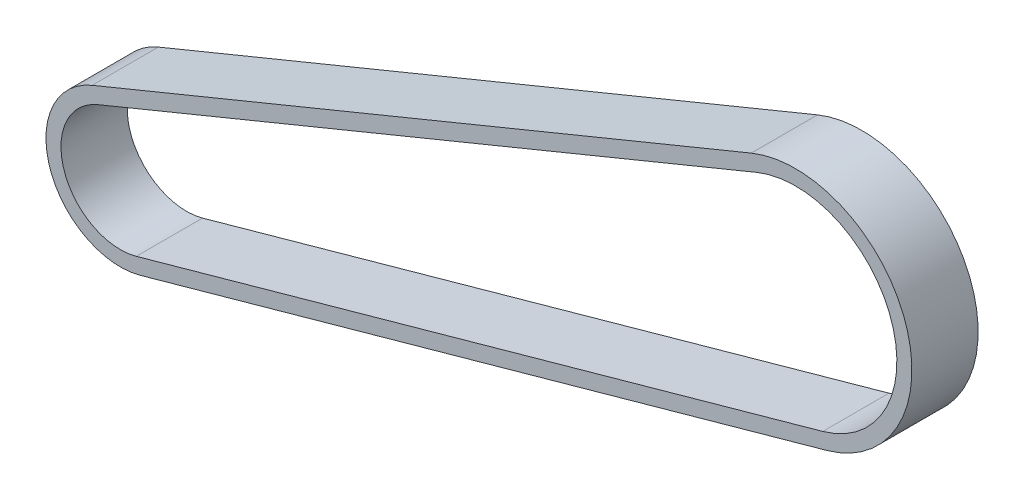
from build123d import *

# Parameters (mm, degrees)
BOSS_EXTRUDE1_DEPTH = 3


with BuildPart() as part:
    # Sketch2 → Boss-Extrude1 (new, symmetric)
    with BuildSketch(Plane.XY):
        with BuildLine():
            Line((-59.338715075, -27.506095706), (2.833816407, -10.152938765))
            ThreePointArc((2.833816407, -10.152938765), (9.9686654, 3.426133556), (-4.006585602, 9.749869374))
            Line((-4.006585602, 9.749869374), (-63.710881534, -14.784856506))
            ThreePointArc((-63.710881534, -14.784856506), (-67.521652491, -23.206536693), (-59.338715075, -27.506095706))
        make_face()
        with BuildLine():
            Line((-63.193951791, -16.042784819), (-3.489655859, 8.491941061))
            ThreePointArc((-3.489655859, 8.491941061), (8.68250802, 2.984093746), (2.468197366, -8.843006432))
            Line((2.468197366, -8.843006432), (-59.704334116, -26.196163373))
            ThreePointArc((-59.704334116, -26.196163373), (-66.235495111, -22.764496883), (-63.193951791, -16.042784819))
        make_face(mode=Mode.SUBTRACT)
    extrude(amount=BOSS_EXTRUDE1_DEPTH, both=True)


solid = part.part
